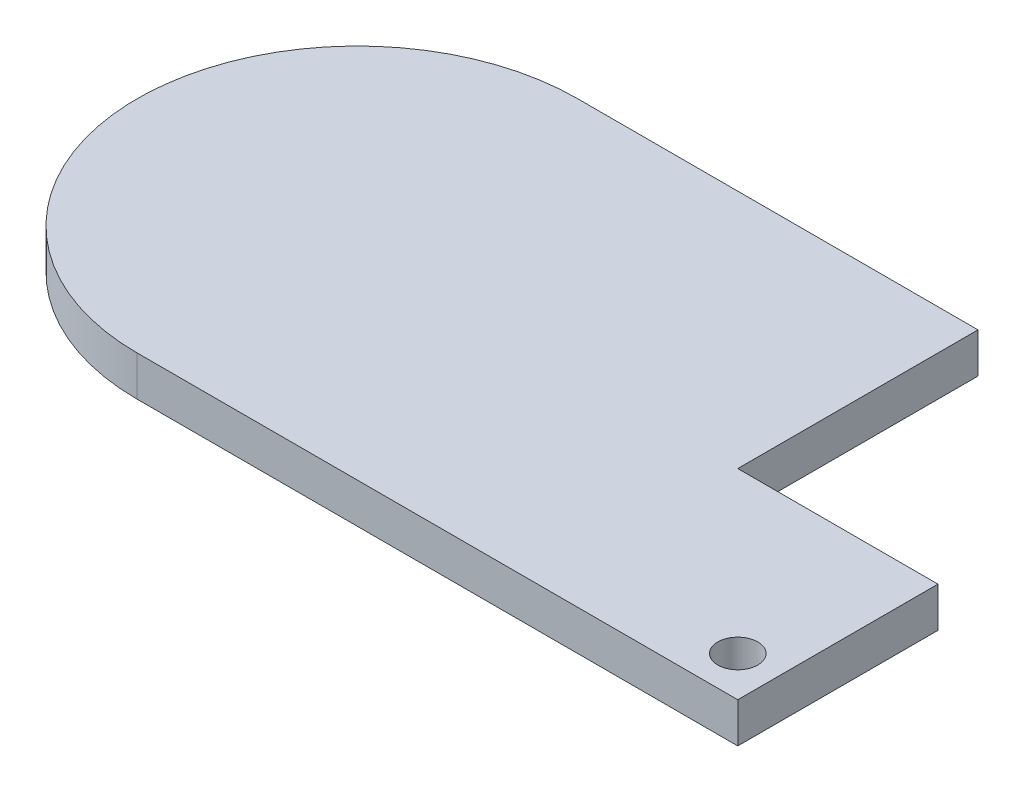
ISO-10303-21;
HEADER;
FILE_DESCRIPTION(('STEP AP214'),'2;1');
FILE_NAME('part.step','',(''),(''),'','','');
FILE_SCHEMA(('AUTOMOTIVE_DESIGN { 1 0 10303 214 1 1 1 1 }'));
ENDSEC;
DATA;
#1=APPLICATION_CONTEXT('core data for automotive mechanical design processes');
#2=APPLICATION_PROTOCOL_DEFINITION('international standard','automotive_design',2000,#1);
#3=PRODUCT_CONTEXT('',#1,'mechanical');
#4=PRODUCT('Part','Part','',(#3));
#5=PRODUCT_RELATED_PRODUCT_CATEGORY('part','',(#4));
#6=PRODUCT_DEFINITION_FORMATION('','',#4);
#7=PRODUCT_DEFINITION_CONTEXT('part definition',#1,'design');
#8=PRODUCT_DEFINITION('design','',#6,#7);
#9=PRODUCT_DEFINITION_SHAPE('','',#8);
#10=(LENGTH_UNIT() NAMED_UNIT(*) SI_UNIT(.MILLI.,.METRE.));
#11=(NAMED_UNIT(*) PLANE_ANGLE_UNIT() SI_UNIT($,.RADIAN.));
#12=(NAMED_UNIT(*) SI_UNIT($,.STERADIAN.) SOLID_ANGLE_UNIT());
#13=UNCERTAINTY_MEASURE_WITH_UNIT(LENGTH_MEASURE(1.E-05),#10,'distance_accuracy_value','');
#14=(GEOMETRIC_REPRESENTATION_CONTEXT(3) GLOBAL_UNCERTAINTY_ASSIGNED_CONTEXT((#13)) GLOBAL_UNIT_ASSIGNED_CONTEXT((#10,
#11,#12)) REPRESENTATION_CONTEXT('',''));
#15=CARTESIAN_POINT('',(0.,0.,0.));
#16=DIRECTION('',(0.,0.,1.));
#17=DIRECTION('',(1.,0.,0.));
#18=AXIS2_PLACEMENT_3D('',#15,#16,#17);
#19=CARTESIAN_POINT('',(0.,10.,-55.));
#20=DIRECTION('',(0.,-1.,0.));
#21=DIRECTION('',(0.,0.,-1.));
#22=AXIS2_PLACEMENT_3D('',#19,#20,#21);
#23=CYLINDRICAL_SURFACE('',#22,55.);
#24=CARTESIAN_POINT('',(0.,0.,-55.));
#25=DIRECTION('',(0.,1.,0.));
#26=DIRECTION('',(0.,0.,1.));
#27=AXIS2_PLACEMENT_3D('',#24,#25,#26);
#28=CIRCLE('',#27,55.);
#29=CARTESIAN_POINT('',(0.,0.,-110.));
#30=VERTEX_POINT('',#29);
#31=CARTESIAN_POINT('',(0.,0.,0.));
#32=VERTEX_POINT('',#31);
#33=EDGE_CURVE('E89',#30,#32,#28,.T.);
#34=ORIENTED_EDGE('',*,*,#33,.T.);
#35=DIRECTION('',(0.,-1.,0.));
#36=VECTOR('',#35,1.);
#37=CARTESIAN_POINT('',(0.,10.,0.));
#38=LINE('',#37,#36);
#39=CARTESIAN_POINT('',(0.,10.,0.));
#40=VERTEX_POINT('',#39);
#41=EDGE_CURVE('E11',#40,#32,#38,.T.);
#42=ORIENTED_EDGE('',*,*,#41,.F.);
#43=CARTESIAN_POINT('',(0.,10.,-55.));
#44=DIRECTION('',(0.,1.,0.));
#45=DIRECTION('',(0.,0.,1.));
#46=AXIS2_PLACEMENT_3D('',#43,#44,#45);
#47=CIRCLE('',#46,55.);
#48=CARTESIAN_POINT('',(0.,10.,-110.));
#49=VERTEX_POINT('',#48);
#50=EDGE_CURVE('E117',#49,#40,#47,.T.);
#51=ORIENTED_EDGE('',*,*,#50,.F.);
#52=DIRECTION('',(0.,-1.,0.));
#53=VECTOR('',#52,1.);
#54=CARTESIAN_POINT('',(0.,10.,-110.));
#55=LINE('',#54,#53);
#56=EDGE_CURVE('E102',#49,#30,#55,.T.);
#57=ORIENTED_EDGE('',*,*,#56,.T.);
#58=EDGE_LOOP('',(#34,#42,#51,#57));
#59=FACE_BOUND('',#58,.T.);
#60=ADVANCED_FACE('F33',(#59),#23,.T.);
#61=CARTESIAN_POINT('',(0.,10.,0.));
#62=DIRECTION('',(0.,0.,-1.));
#63=DIRECTION('',(-1.,0.,0.));
#64=AXIS2_PLACEMENT_3D('',#61,#62,#63);
#65=PLANE('',#64);
#66=DIRECTION('',(1.,0.,0.));
#67=VECTOR('',#66,1.);
#68=CARTESIAN_POINT('',(0.,0.,0.));
#69=LINE('',#68,#67);
#70=CARTESIAN_POINT('',(150.,0.,0.));
#71=VERTEX_POINT('',#70);
#72=EDGE_CURVE('E85',#32,#71,#69,.T.);
#73=ORIENTED_EDGE('',*,*,#72,.T.);
#74=DIRECTION('',(0.,-1.,0.));
#75=VECTOR('',#74,1.);
#76=CARTESIAN_POINT('',(150.,10.,0.));
#77=LINE('',#76,#75);
#78=CARTESIAN_POINT('',(150.,10.,0.));
#79=VERTEX_POINT('',#78);
#80=EDGE_CURVE('E40',#79,#71,#77,.T.);
#81=ORIENTED_EDGE('',*,*,#80,.F.);
#82=DIRECTION('',(1.,0.,0.));
#83=VECTOR('',#82,1.);
#84=CARTESIAN_POINT('',(0.,10.,0.));
#85=LINE('',#84,#83);
#86=EDGE_CURVE('E98',#40,#79,#85,.T.);
#87=ORIENTED_EDGE('',*,*,#86,.F.);
#88=ORIENTED_EDGE('',*,*,#41,.T.);
#89=EDGE_LOOP('',(#73,#81,#87,#88));
#90=FACE_BOUND('',#89,.T.);
#91=ADVANCED_FACE('F97',(#90),#65,.F.);
#92=CARTESIAN_POINT('',(150.,10.,0.));
#93=DIRECTION('',(-1.,0.,0.));
#94=DIRECTION('',(0.,0.,1.));
#95=AXIS2_PLACEMENT_3D('',#92,#93,#94);
#96=PLANE('',#95);
#97=DIRECTION('',(0.,0.,-1.));
#98=VECTOR('',#97,1.);
#99=CARTESIAN_POINT('',(150.,0.,0.));
#100=LINE('',#99,#98);
#101=CARTESIAN_POINT('',(150.,0.,-50.));
#102=VERTEX_POINT('',#101);
#103=EDGE_CURVE('E91',#71,#102,#100,.T.);
#104=ORIENTED_EDGE('',*,*,#103,.T.);
#105=DIRECTION('',(0.,-1.,0.));
#106=VECTOR('',#105,1.);
#107=CARTESIAN_POINT('',(150.,10.,-50.));
#108=LINE('',#107,#106);
#109=CARTESIAN_POINT('',(150.,10.,-50.));
#110=VERTEX_POINT('',#109);
#111=EDGE_CURVE('E133',#110,#102,#108,.T.);
#112=ORIENTED_EDGE('',*,*,#111,.F.);
#113=DIRECTION('',(0.,0.,-1.));
#114=VECTOR('',#113,1.);
#115=CARTESIAN_POINT('',(150.,10.,0.));
#116=LINE('',#115,#114);
#117=EDGE_CURVE('E120',#79,#110,#116,.T.);
#118=ORIENTED_EDGE('',*,*,#117,.F.);
#119=ORIENTED_EDGE('',*,*,#80,.T.);
#120=EDGE_LOOP('',(#104,#112,#118,#119));
#121=FACE_BOUND('',#120,.T.);
#122=ADVANCED_FACE('F137',(#121),#96,.F.);
#123=CARTESIAN_POINT('',(150.,10.,-50.));
#124=DIRECTION('',(0.,0.,1.));
#125=DIRECTION('',(1.,0.,0.));
#126=AXIS2_PLACEMENT_3D('',#123,#124,#125);
#127=PLANE('',#126);
#128=DIRECTION('',(-1.,0.,0.));
#129=VECTOR('',#128,1.);
#130=CARTESIAN_POINT('',(150.,0.,-50.));
#131=LINE('',#130,#129);
#132=CARTESIAN_POINT('',(100.,0.,-50.));
#133=VERTEX_POINT('',#132);
#134=EDGE_CURVE('E111',#102,#133,#131,.T.);
#135=ORIENTED_EDGE('',*,*,#134,.T.);
#136=DIRECTION('',(0.,-1.,0.));
#137=VECTOR('',#136,1.);
#138=CARTESIAN_POINT('',(100.,10.,-50.));
#139=LINE('',#138,#137);
#140=CARTESIAN_POINT('',(100.,10.,-50.));
#141=VERTEX_POINT('',#140);
#142=EDGE_CURVE('E130',#141,#133,#139,.T.);
#143=ORIENTED_EDGE('',*,*,#142,.F.);
#144=DIRECTION('',(-1.,0.,0.));
#145=VECTOR('',#144,1.);
#146=CARTESIAN_POINT('',(150.,10.,-50.));
#147=LINE('',#146,#145);
#148=EDGE_CURVE('E122',#110,#141,#147,.T.);
#149=ORIENTED_EDGE('',*,*,#148,.F.);
#150=ORIENTED_EDGE('',*,*,#111,.T.);
#151=EDGE_LOOP('',(#135,#143,#149,#150));
#152=FACE_BOUND('',#151,.T.);
#153=ADVANCED_FACE('F143',(#152),#127,.F.);
#154=CARTESIAN_POINT('',(100.,10.,-50.));
#155=DIRECTION('',(-1.,0.,0.));
#156=DIRECTION('',(0.,0.,1.));
#157=AXIS2_PLACEMENT_3D('',#154,#155,#156);
#158=PLANE('',#157);
#159=DIRECTION('',(0.,0.,-1.));
#160=VECTOR('',#159,1.);
#161=CARTESIAN_POINT('',(100.,0.,-50.));
#162=LINE('',#161,#160);
#163=CARTESIAN_POINT('',(100.,0.,-110.));
#164=VERTEX_POINT('',#163);
#165=EDGE_CURVE('E113',#133,#164,#162,.T.);
#166=ORIENTED_EDGE('',*,*,#165,.T.);
#167=DIRECTION('',(0.,-1.,0.));
#168=VECTOR('',#167,1.);
#169=CARTESIAN_POINT('',(100.,10.,-110.));
#170=LINE('',#169,#168);
#171=CARTESIAN_POINT('',(100.,10.,-110.));
#172=VERTEX_POINT('',#171);
#173=EDGE_CURVE('E127',#172,#164,#170,.T.);
#174=ORIENTED_EDGE('',*,*,#173,.F.);
#175=DIRECTION('',(0.,0.,-1.));
#176=VECTOR('',#175,1.);
#177=CARTESIAN_POINT('',(100.,10.,-50.));
#178=LINE('',#177,#176);
#179=EDGE_CURVE('E52',#141,#172,#178,.T.);
#180=ORIENTED_EDGE('',*,*,#179,.F.);
#181=ORIENTED_EDGE('',*,*,#142,.T.);
#182=EDGE_LOOP('',(#166,#174,#180,#181));
#183=FACE_BOUND('',#182,.T.);
#184=ADVANCED_FACE('F146',(#183),#158,.F.);
#185=CARTESIAN_POINT('',(100.,10.,-110.));
#186=DIRECTION('',(0.,0.,1.));
#187=DIRECTION('',(1.,0.,0.));
#188=AXIS2_PLACEMENT_3D('',#185,#186,#187);
#189=PLANE('',#188);
#190=DIRECTION('',(-1.,0.,0.));
#191=VECTOR('',#190,1.);
#192=CARTESIAN_POINT('',(100.,0.,-110.));
#193=LINE('',#192,#191);
#194=EDGE_CURVE('E115',#164,#30,#193,.T.);
#195=ORIENTED_EDGE('',*,*,#194,.T.);
#196=ORIENTED_EDGE('',*,*,#56,.F.);
#197=DIRECTION('',(-1.,0.,0.));
#198=VECTOR('',#197,1.);
#199=CARTESIAN_POINT('',(100.,10.,-110.));
#200=LINE('',#199,#198);
#201=EDGE_CURVE('E47',#172,#49,#200,.T.);
#202=ORIENTED_EDGE('',*,*,#201,.F.);
#203=ORIENTED_EDGE('',*,*,#173,.T.);
#204=EDGE_LOOP('',(#195,#196,#202,#203));
#205=FACE_BOUND('',#204,.T.);
#206=ADVANCED_FACE('F148',(#205),#189,.F.);
#207=CARTESIAN_POINT('',(0.,10.,-55.));
#208=DIRECTION('',(0.,1.,0.));
#209=DIRECTION('',(0.,0.,1.));
#210=AXIS2_PLACEMENT_3D('',#207,#208,#209);
#211=PLANE('',#210);
#212=CARTESIAN_POINT('',(140.,10.,-10.));
#213=DIRECTION('',(0.,1.,0.));
#214=DIRECTION('',(0.,0.,1.));
#215=AXIS2_PLACEMENT_3D('',#212,#213,#214);
#216=CIRCLE('',#215,5.00000000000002);
#217=CARTESIAN_POINT('',(140.,10.,-4.99999999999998));
#218=VERTEX_POINT('',#217);
#219=EDGE_CURVE('E106',#218,#218,#216,.T.);
#220=ORIENTED_EDGE('',*,*,#219,.F.);
#221=EDGE_LOOP('',(#220));
#222=FACE_BOUND('',#221,.T.);
#223=ORIENTED_EDGE('',*,*,#50,.T.);
#224=ORIENTED_EDGE('',*,*,#86,.T.);
#225=ORIENTED_EDGE('',*,*,#117,.T.);
#226=ORIENTED_EDGE('',*,*,#148,.T.);
#227=ORIENTED_EDGE('',*,*,#179,.T.);
#228=ORIENTED_EDGE('',*,*,#201,.T.);
#229=EDGE_LOOP('',(#223,#224,#225,#226,#227,#228));
#230=FACE_BOUND('',#229,.T.);
#231=ADVANCED_FACE('F140',(#222,#230),#211,.T.);
#232=CARTESIAN_POINT('',(0.,0.,-55.));
#233=DIRECTION('',(0.,1.,0.));
#234=DIRECTION('',(0.,0.,1.));
#235=AXIS2_PLACEMENT_3D('',#232,#233,#234);
#236=PLANE('',#235);
#237=CARTESIAN_POINT('',(140.,0.,-10.));
#238=DIRECTION('',(0.,1.,0.));
#239=DIRECTION('',(0.,0.,1.));
#240=AXIS2_PLACEMENT_3D('',#237,#238,#239);
#241=CIRCLE('',#240,5.00000000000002);
#242=CARTESIAN_POINT('',(140.,0.,-4.99999999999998));
#243=VERTEX_POINT('',#242);
#244=EDGE_CURVE('E103',#243,#243,#241,.T.);
#245=ORIENTED_EDGE('',*,*,#244,.T.);
#246=EDGE_LOOP('',(#245));
#247=FACE_BOUND('',#246,.T.);
#248=ORIENTED_EDGE('',*,*,#33,.F.);
#249=ORIENTED_EDGE('',*,*,#194,.F.);
#250=ORIENTED_EDGE('',*,*,#165,.F.);
#251=ORIENTED_EDGE('',*,*,#134,.F.);
#252=ORIENTED_EDGE('',*,*,#103,.F.);
#253=ORIENTED_EDGE('',*,*,#72,.F.);
#254=EDGE_LOOP('',(#248,#249,#250,#251,#252,#253));
#255=FACE_BOUND('',#254,.T.);
#256=ADVANCED_FACE('F86',(#247,#255),#236,.F.);
#257=CARTESIAN_POINT('',(140.,0.,-10.));
#258=DIRECTION('',(0.,1.,0.));
#259=DIRECTION('',(0.,0.,1.));
#260=AXIS2_PLACEMENT_3D('',#257,#258,#259);
#261=CYLINDRICAL_SURFACE('',#260,5.00000000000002);
#262=ORIENTED_EDGE('',*,*,#244,.F.);
#263=EDGE_LOOP('',(#262));
#264=FACE_BOUND('',#263,.T.);
#265=ORIENTED_EDGE('',*,*,#219,.T.);
#266=EDGE_LOOP('',(#265));
#267=FACE_BOUND('',#266,.T.);
#268=ADVANCED_FACE('F195',(#264,#267),#261,.F.);
#269=CLOSED_SHELL('',(#60,#91,#122,#153,#184,#206,#231,#256,#268));
#270=MANIFOLD_SOLID_BREP('B2',#269);
#271=ADVANCED_BREP_SHAPE_REPRESENTATION('',(#18,#270),#14);
#272=SHAPE_DEFINITION_REPRESENTATION(#9,#271);
ENDSEC;
END-ISO-10303-21;
